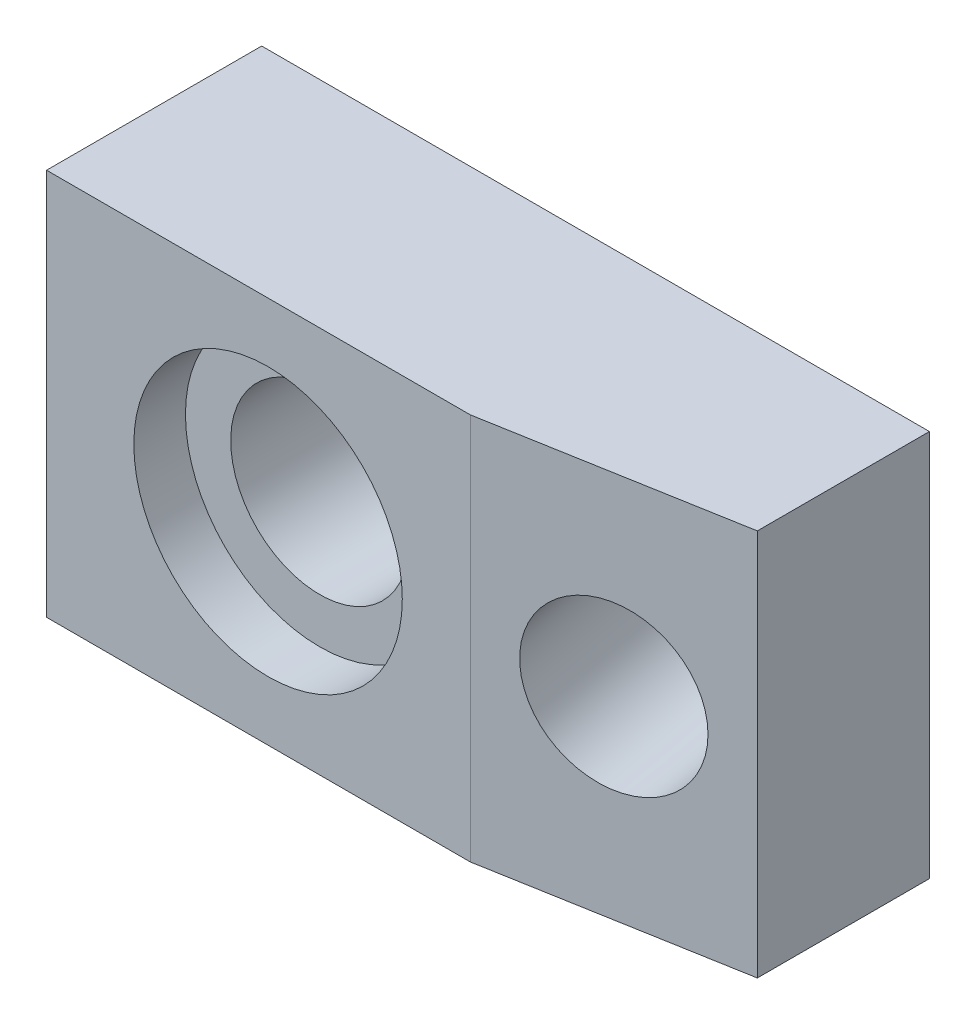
ISO-10303-21;
HEADER;
FILE_DESCRIPTION(('STEP AP214'),'2;1');
FILE_NAME('part.step','',(''),(''),'','','');
FILE_SCHEMA(('AUTOMOTIVE_DESIGN { 1 0 10303 214 1 1 1 1 }'));
ENDSEC;
DATA;
#1=APPLICATION_CONTEXT('core data for automotive mechanical design processes');
#2=APPLICATION_PROTOCOL_DEFINITION('international standard','automotive_design',2000,#1);
#3=PRODUCT_CONTEXT('',#1,'mechanical');
#4=PRODUCT('Part','Part','',(#3));
#5=PRODUCT_RELATED_PRODUCT_CATEGORY('part','',(#4));
#6=PRODUCT_DEFINITION_FORMATION('','',#4);
#7=PRODUCT_DEFINITION_CONTEXT('part definition',#1,'design');
#8=PRODUCT_DEFINITION('design','',#6,#7);
#9=PRODUCT_DEFINITION_SHAPE('','',#8);
#10=(LENGTH_UNIT() NAMED_UNIT(*) SI_UNIT(.MILLI.,.METRE.));
#11=(NAMED_UNIT(*) PLANE_ANGLE_UNIT() SI_UNIT($,.RADIAN.));
#12=(NAMED_UNIT(*) SI_UNIT($,.STERADIAN.) SOLID_ANGLE_UNIT());
#13=UNCERTAINTY_MEASURE_WITH_UNIT(LENGTH_MEASURE(1.E-05),#10,'distance_accuracy_value','');
#14=(GEOMETRIC_REPRESENTATION_CONTEXT(3) GLOBAL_UNCERTAINTY_ASSIGNED_CONTEXT((#13)) GLOBAL_UNIT_ASSIGNED_CONTEXT((#10,
#11,#12)) REPRESENTATION_CONTEXT('',''));
#15=CARTESIAN_POINT('',(0.,0.,0.));
#16=DIRECTION('',(0.,0.,1.));
#17=DIRECTION('',(1.,0.,0.));
#18=AXIS2_PLACEMENT_3D('',#15,#16,#17);
#19=CARTESIAN_POINT('',(-16.3449,14.2875,15.875));
#20=DIRECTION('',(0.,0.,-1.));
#21=DIRECTION('',(-1.,0.,0.));
#22=AXIS2_PLACEMENT_3D('',#19,#20,#21);
#23=PLANE('',#22);
#24=DIRECTION('',(1.,0.,0.));
#25=VECTOR('',#24,1.);
#26=CARTESIAN_POINT('',(-16.3449,-14.2875,15.875));
#27=LINE('',#26,#25);
#28=CARTESIAN_POINT('',(-16.3449,-14.2875,15.875));
#29=VERTEX_POINT('',#28);
#30=CARTESIAN_POINT('',(14.9247802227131,-14.2875,15.875));
#31=VERTEX_POINT('',#30);
#32=EDGE_CURVE('E63',#29,#31,#27,.T.);
#33=ORIENTED_EDGE('',*,*,#32,.T.);
#34=DIRECTION('',(0.,-1.,0.));
#35=VECTOR('',#34,1.);
#36=CARTESIAN_POINT('',(14.9247802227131,14.2875,15.875));
#37=LINE('',#36,#35);
#38=CARTESIAN_POINT('',(14.9247802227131,14.2875,15.875));
#39=VERTEX_POINT('',#38);
#40=EDGE_CURVE('E23',#39,#31,#37,.T.);
#41=ORIENTED_EDGE('',*,*,#40,.F.);
#42=DIRECTION('',(1.,0.,0.));
#43=VECTOR('',#42,1.);
#44=CARTESIAN_POINT('',(-16.3449,14.2875,15.875));
#45=LINE('',#44,#43);
#46=CARTESIAN_POINT('',(-16.3449,14.2875,15.875));
#47=VERTEX_POINT('',#46);
#48=EDGE_CURVE('E76',#47,#39,#45,.T.);
#49=ORIENTED_EDGE('',*,*,#48,.F.);
#50=DIRECTION('',(0.,-1.,0.));
#51=VECTOR('',#50,1.);
#52=CARTESIAN_POINT('',(-16.3449,14.2875,15.875));
#53=LINE('',#52,#51);
#54=EDGE_CURVE('E9',#47,#29,#53,.T.);
#55=ORIENTED_EDGE('',*,*,#54,.T.);
#56=EDGE_LOOP('',(#33,#41,#49,#55));
#57=FACE_BOUND('',#56,.T.);
#58=CARTESIAN_POINT('',(0.,0.,15.875));
#59=DIRECTION('',(0.,0.,-1.));
#60=DIRECTION('',(-1.,0.,0.));
#61=AXIS2_PLACEMENT_3D('',#58,#59,#60);
#62=CIRCLE('',#61,9.906);
#63=CARTESIAN_POINT('',(-9.906,0.,15.875));
#64=VERTEX_POINT('',#63);
#65=EDGE_CURVE('E18',#64,#64,#62,.F.);
#66=ORIENTED_EDGE('',*,*,#65,.F.);
#67=EDGE_LOOP('',(#66));
#68=FACE_BOUND('',#67,.T.);
#69=ADVANCED_FACE('F14',(#57,#68),#23,.F.);
#70=CARTESIAN_POINT('',(32.9311,14.2875,0.));
#71=DIRECTION('',(0.,0.,1.));
#72=DIRECTION('',(0.,1.,0.));
#73=AXIS2_PLACEMENT_3D('',#70,#71,#72);
#74=PLANE('',#73);
#75=CARTESIAN_POINT('',(21.4086683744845,0.,0.));
#76=DIRECTION('',(0.,0.,1.));
#77=DIRECTION('',(1.,0.,0.));
#78=AXIS2_PLACEMENT_3D('',#75,#76,#77);
#79=ELLIPSE('',#78,6.09255967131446,6.);
#80=CARTESIAN_POINT('',(27.5012280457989,0.,0.));
#81=VERTEX_POINT('',#80);
#82=EDGE_CURVE('E115',#81,#81,#79,.T.);
#83=ORIENTED_EDGE('',*,*,#82,.T.);
#84=EDGE_LOOP('',(#83));
#85=FACE_BOUND('',#84,.T.);
#86=DIRECTION('',(-1.,0.,0.));
#87=VECTOR('',#86,1.);
#88=CARTESIAN_POINT('',(32.9311,-14.2875,0.));
#89=LINE('',#88,#87);
#90=CARTESIAN_POINT('',(32.9311,-14.2875,0.));
#91=VERTEX_POINT('',#90);
#92=CARTESIAN_POINT('',(-16.3449,-14.2875,0.));
#93=VERTEX_POINT('',#92);
#94=EDGE_CURVE('E91',#91,#93,#89,.T.);
#95=ORIENTED_EDGE('',*,*,#94,.T.);
#96=DIRECTION('',(0.,-1.,0.));
#97=VECTOR('',#96,1.);
#98=CARTESIAN_POINT('',(-16.3449,14.2875,0.));
#99=LINE('',#98,#97);
#100=CARTESIAN_POINT('',(-16.3449,14.2875,0.));
#101=VERTEX_POINT('',#100);
#102=EDGE_CURVE('E80',#101,#93,#99,.T.);
#103=ORIENTED_EDGE('',*,*,#102,.F.);
#104=DIRECTION('',(-1.,0.,0.));
#105=VECTOR('',#104,1.);
#106=CARTESIAN_POINT('',(32.9311,14.2875,0.));
#107=LINE('',#106,#105);
#108=CARTESIAN_POINT('',(32.9311,14.2875,0.));
#109=VERTEX_POINT('',#108);
#110=EDGE_CURVE('E31',#109,#101,#107,.T.);
#111=ORIENTED_EDGE('',*,*,#110,.F.);
#112=DIRECTION('',(0.,-1.,0.));
#113=VECTOR('',#112,1.);
#114=CARTESIAN_POINT('',(32.9311,14.2875,0.));
#115=LINE('',#114,#113);
#116=EDGE_CURVE('E101',#109,#91,#115,.T.);
#117=ORIENTED_EDGE('',*,*,#116,.T.);
#118=EDGE_LOOP('',(#95,#103,#111,#117));
#119=FACE_BOUND('',#118,.T.);
#120=CARTESIAN_POINT('',(0.,0.,0.));
#121=DIRECTION('',(0.,0.,1.));
#122=DIRECTION('',(0.,1.,0.));
#123=AXIS2_PLACEMENT_3D('',#120,#121,#122);
#124=CIRCLE('',#123,6.5659);
#125=CARTESIAN_POINT('',(0.,6.5659,0.));
#126=VERTEX_POINT('',#125);
#127=EDGE_CURVE('E83',#126,#126,#124,.F.);
#128=ORIENTED_EDGE('',*,*,#127,.F.);
#129=EDGE_LOOP('',(#128));
#130=FACE_BOUND('',#129,.T.);
#131=ADVANCED_FACE('F137',(#85,#119,#130),#74,.F.);
#132=CARTESIAN_POINT('',(-16.3449,14.2875,0.));
#133=DIRECTION('',(1.,0.,0.));
#134=DIRECTION('',(0.,0.,-1.));
#135=AXIS2_PLACEMENT_3D('',#132,#133,#134);
#136=PLANE('',#135);
#137=DIRECTION('',(0.,0.,1.));
#138=VECTOR('',#137,1.);
#139=CARTESIAN_POINT('',(-16.3449,-14.2875,0.));
#140=LINE('',#139,#138);
#141=EDGE_CURVE('E67',#93,#29,#140,.T.);
#142=ORIENTED_EDGE('',*,*,#141,.T.);
#143=ORIENTED_EDGE('',*,*,#54,.F.);
#144=DIRECTION('',(0.,0.,1.));
#145=VECTOR('',#144,1.);
#146=CARTESIAN_POINT('',(-16.3449,14.2875,0.));
#147=LINE('',#146,#145);
#148=EDGE_CURVE('E93',#101,#47,#147,.T.);
#149=ORIENTED_EDGE('',*,*,#148,.F.);
#150=ORIENTED_EDGE('',*,*,#102,.T.);
#151=EDGE_LOOP('',(#142,#143,#149,#150));
#152=FACE_BOUND('',#151,.T.);
#153=ADVANCED_FACE('F16',(#152),#136,.F.);
#154=CARTESIAN_POINT('',(14.9247802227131,14.2875,15.875));
#155=DIRECTION('',(-0.173648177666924,0.,-0.984807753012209));
#156=DIRECTION('',(-0.984807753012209,0.,0.173648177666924));
#157=AXIS2_PLACEMENT_3D('',#154,#155,#156);
#158=PLANE('',#157);
#159=CARTESIAN_POINT('',(23.9279401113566,0.,14.2875));
#160=DIRECTION('',(0.173648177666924,0.,0.984807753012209));
#161=DIRECTION('',(0.984807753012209,0.,-0.173648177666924));
#162=AXIS2_PLACEMENT_3D('',#159,#160,#161);
#163=CIRCLE('',#162,6.);
#164=CARTESIAN_POINT('',(29.8367866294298,0.,13.2456109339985));
#165=VERTEX_POINT('',#164);
#166=EDGE_CURVE('E119',#165,#165,#163,.T.);
#167=ORIENTED_EDGE('',*,*,#166,.F.);
#168=EDGE_LOOP('',(#167));
#169=FACE_BOUND('',#168,.T.);
#170=DIRECTION('',(0.984807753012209,0.,-0.173648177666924));
#171=VECTOR('',#170,1.);
#172=CARTESIAN_POINT('',(14.9247802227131,-14.2875,15.875));
#173=LINE('',#172,#171);
#174=CARTESIAN_POINT('',(32.9311,-14.2875,12.7));
#175=VERTEX_POINT('',#174);
#176=EDGE_CURVE('E69',#31,#175,#173,.T.);
#177=ORIENTED_EDGE('',*,*,#176,.T.);
#178=DIRECTION('',(0.,-1.,0.));
#179=VECTOR('',#178,1.);
#180=CARTESIAN_POINT('',(32.9311,14.2875,12.7));
#181=LINE('',#180,#179);
#182=CARTESIAN_POINT('',(32.9311,14.2875,12.7));
#183=VERTEX_POINT('',#182);
#184=EDGE_CURVE('E104',#183,#175,#181,.T.);
#185=ORIENTED_EDGE('',*,*,#184,.F.);
#186=DIRECTION('',(0.984807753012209,0.,-0.173648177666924));
#187=VECTOR('',#186,1.);
#188=CARTESIAN_POINT('',(14.9247802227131,14.2875,15.875));
#189=LINE('',#188,#187);
#190=EDGE_CURVE('E96',#39,#183,#189,.T.);
#191=ORIENTED_EDGE('',*,*,#190,.F.);
#192=ORIENTED_EDGE('',*,*,#40,.T.);
#193=EDGE_LOOP('',(#177,#185,#191,#192));
#194=FACE_BOUND('',#193,.T.);
#195=ADVANCED_FACE('F128',(#169,#194),#158,.F.);
#196=CARTESIAN_POINT('',(32.9311,14.2875,12.7));
#197=DIRECTION('',(-1.,0.,0.));
#198=DIRECTION('',(0.,0.,1.));
#199=AXIS2_PLACEMENT_3D('',#196,#197,#198);
#200=PLANE('',#199);
#201=DIRECTION('',(0.,0.,-1.));
#202=VECTOR('',#201,1.);
#203=CARTESIAN_POINT('',(32.9311,-14.2875,12.7));
#204=LINE('',#203,#202);
#205=EDGE_CURVE('E89',#175,#91,#204,.T.);
#206=ORIENTED_EDGE('',*,*,#205,.T.);
#207=ORIENTED_EDGE('',*,*,#116,.F.);
#208=DIRECTION('',(0.,0.,-1.));
#209=VECTOR('',#208,1.);
#210=CARTESIAN_POINT('',(32.9311,14.2875,12.7));
#211=LINE('',#210,#209);
#212=EDGE_CURVE('E36',#183,#109,#211,.T.);
#213=ORIENTED_EDGE('',*,*,#212,.F.);
#214=ORIENTED_EDGE('',*,*,#184,.T.);
#215=EDGE_LOOP('',(#206,#207,#213,#214));
#216=FACE_BOUND('',#215,.T.);
#217=ADVANCED_FACE('F131',(#216),#200,.F.);
#218=CARTESIAN_POINT('',(-16.3449,14.2875,0.));
#219=DIRECTION('',(0.,-1.,0.));
#220=DIRECTION('',(0.,0.,1.));
#221=AXIS2_PLACEMENT_3D('',#218,#219,#220);
#222=PLANE('',#221);
#223=ORIENTED_EDGE('',*,*,#148,.T.);
#224=ORIENTED_EDGE('',*,*,#48,.T.);
#225=ORIENTED_EDGE('',*,*,#190,.T.);
#226=ORIENTED_EDGE('',*,*,#212,.T.);
#227=ORIENTED_EDGE('',*,*,#110,.T.);
#228=EDGE_LOOP('',(#223,#224,#225,#226,#227));
#229=FACE_BOUND('',#228,.T.);
#230=ADVANCED_FACE('F139',(#229),#222,.F.);
#231=CARTESIAN_POINT('',(-16.3449,-14.2875,0.));
#232=DIRECTION('',(0.,-1.,0.));
#233=DIRECTION('',(0.,0.,1.));
#234=AXIS2_PLACEMENT_3D('',#231,#232,#233);
#235=PLANE('',#234);
#236=ORIENTED_EDGE('',*,*,#141,.F.);
#237=ORIENTED_EDGE('',*,*,#94,.F.);
#238=ORIENTED_EDGE('',*,*,#205,.F.);
#239=ORIENTED_EDGE('',*,*,#176,.F.);
#240=ORIENTED_EDGE('',*,*,#32,.F.);
#241=EDGE_LOOP('',(#236,#237,#238,#239,#240));
#242=FACE_BOUND('',#241,.T.);
#243=ADVANCED_FACE('F64',(#242),#235,.T.);
#244=CARTESIAN_POINT('',(0.,0.,20.5115227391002));
#245=DIRECTION('',(0.,0.,1.));
#246=DIRECTION('',(0.,1.,0.));
#247=AXIS2_PLACEMENT_3D('',#244,#245,#246);
#248=CYLINDRICAL_SURFACE('',#247,9.906);
#249=CARTESIAN_POINT('',(0.,0.,12.065));
#250=DIRECTION('',(0.,0.,1.));
#251=DIRECTION('',(0.,1.,0.));
#252=AXIS2_PLACEMENT_3D('',#249,#250,#251);
#253=CIRCLE('',#252,9.906);
#254=CARTESIAN_POINT('',(0.,9.906,12.065));
#255=VERTEX_POINT('',#254);
#256=EDGE_CURVE('E85',#255,#255,#253,.T.);
#257=ORIENTED_EDGE('',*,*,#256,.F.);
#258=EDGE_LOOP('',(#257));
#259=FACE_BOUND('',#258,.T.);
#260=ORIENTED_EDGE('',*,*,#65,.T.);
#261=EDGE_LOOP('',(#260));
#262=FACE_BOUND('',#261,.T.);
#263=ADVANCED_FACE('F148',(#259,#262),#248,.F.);
#264=CARTESIAN_POINT('',(0.,0.,20.5115227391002));
#265=DIRECTION('',(0.,0.,1.));
#266=DIRECTION('',(0.,1.,0.));
#267=AXIS2_PLACEMENT_3D('',#264,#265,#266);
#268=CYLINDRICAL_SURFACE('',#267,6.5659);
#269=CARTESIAN_POINT('',(0.,0.,12.065));
#270=DIRECTION('',(0.,0.,1.));
#271=DIRECTION('',(0.,1.,0.));
#272=AXIS2_PLACEMENT_3D('',#269,#270,#271);
#273=CIRCLE('',#272,6.5659);
#274=CARTESIAN_POINT('',(0.,6.5659,12.065));
#275=VERTEX_POINT('',#274);
#276=EDGE_CURVE('E111',#275,#275,#273,.T.);
#277=ORIENTED_EDGE('',*,*,#276,.T.);
#278=EDGE_LOOP('',(#277));
#279=FACE_BOUND('',#278,.T.);
#280=ORIENTED_EDGE('',*,*,#127,.T.);
#281=EDGE_LOOP('',(#280));
#282=FACE_BOUND('',#281,.T.);
#283=ADVANCED_FACE('F170',(#279,#282),#268,.F.);
#284=CARTESIAN_POINT('',(-6.5659,0.,12.065));
#285=DIRECTION('',(0.,0.,1.));
#286=DIRECTION('',(0.,1.,0.));
#287=AXIS2_PLACEMENT_3D('',#284,#285,#286);
#288=PLANE('',#287);
#289=ORIENTED_EDGE('',*,*,#256,.T.);
#290=EDGE_LOOP('',(#289));
#291=FACE_BOUND('',#290,.T.);
#292=ORIENTED_EDGE('',*,*,#276,.F.);
#293=EDGE_LOOP('',(#292));
#294=FACE_BOUND('',#293,.T.);
#295=ADVANCED_FACE('F164',(#291,#294),#288,.T.);
#296=CARTESIAN_POINT('',(20.4549765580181,0.,-5.4086550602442));
#297=DIRECTION('',(0.173648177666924,0.,0.984807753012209));
#298=DIRECTION('',(0.984807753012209,0.,-0.173648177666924));
#299=AXIS2_PLACEMENT_3D('',#296,#297,#298);
#300=CYLINDRICAL_SURFACE('',#299,6.);
#301=ORIENTED_EDGE('',*,*,#166,.T.);
#302=EDGE_LOOP('',(#301));
#303=FACE_BOUND('',#302,.T.);
#304=ORIENTED_EDGE('',*,*,#82,.F.);
#305=EDGE_LOOP('',(#304));
#306=FACE_BOUND('',#305,.T.);
#307=ADVANCED_FACE('F125',(#303,#306),#300,.F.);
#308=CLOSED_SHELL('',(#69,#131,#153,#195,#217,#230,#243,#263,#283,#295,#307));
#309=MANIFOLD_SOLID_BREP('B1',#308);
#310=ADVANCED_BREP_SHAPE_REPRESENTATION('',(#18,#309),#14);
#311=SHAPE_DEFINITION_REPRESENTATION(#9,#310);
ENDSEC;
END-ISO-10303-21;
